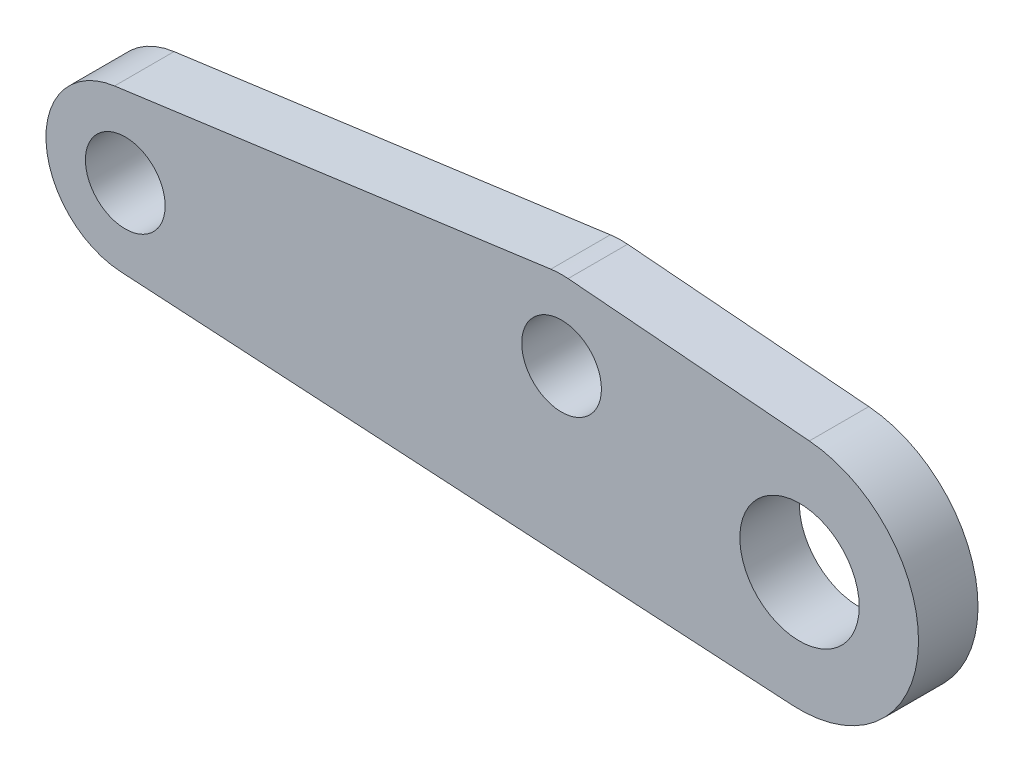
ISO-10303-21;
HEADER;
FILE_DESCRIPTION(('STEP AP214'),'2;1');
FILE_NAME('part.step','',(''),(''),'','','');
FILE_SCHEMA(('AUTOMOTIVE_DESIGN { 1 0 10303 214 1 1 1 1 }'));
ENDSEC;
DATA;
#1=APPLICATION_CONTEXT('core data for automotive mechanical design processes');
#2=APPLICATION_PROTOCOL_DEFINITION('international standard','automotive_design',2000,#1);
#3=PRODUCT_CONTEXT('',#1,'mechanical');
#4=PRODUCT('Part','Part','',(#3));
#5=PRODUCT_RELATED_PRODUCT_CATEGORY('part','',(#4));
#6=PRODUCT_DEFINITION_FORMATION('','',#4);
#7=PRODUCT_DEFINITION_CONTEXT('part definition',#1,'design');
#8=PRODUCT_DEFINITION('design','',#6,#7);
#9=PRODUCT_DEFINITION_SHAPE('','',#8);
#10=(LENGTH_UNIT() NAMED_UNIT(*) SI_UNIT(.MILLI.,.METRE.));
#11=(NAMED_UNIT(*) PLANE_ANGLE_UNIT() SI_UNIT($,.RADIAN.));
#12=(NAMED_UNIT(*) SI_UNIT($,.STERADIAN.) SOLID_ANGLE_UNIT());
#13=UNCERTAINTY_MEASURE_WITH_UNIT(LENGTH_MEASURE(1.E-05),#10,'distance_accuracy_value','');
#14=(GEOMETRIC_REPRESENTATION_CONTEXT(3) GLOBAL_UNCERTAINTY_ASSIGNED_CONTEXT((#13)) GLOBAL_UNIT_ASSIGNED_CONTEXT((#10,
#11,#12)) REPRESENTATION_CONTEXT('',''));
#15=CARTESIAN_POINT('',(0.,0.,0.));
#16=DIRECTION('',(0.,0.,1.));
#17=DIRECTION('',(1.,0.,0.));
#18=AXIS2_PLACEMENT_3D('',#15,#16,#17);
#19=CARTESIAN_POINT('',(0.,0.,15.));
#20=DIRECTION('',(0.,0.,1.));
#21=DIRECTION('',(1.,0.,0.));
#22=AXIS2_PLACEMENT_3D('',#19,#20,#21);
#23=PLANE('',#22);
#24=CARTESIAN_POINT('',(170.,0.,15.));
#25=DIRECTION('',(0.,0.,1.));
#26=DIRECTION('',(1.,0.,0.));
#27=AXIS2_PLACEMENT_3D('',#24,#25,#26);
#28=CIRCLE('',#27,15.05);
#29=CARTESIAN_POINT('',(185.05,0.,15.));
#30=VERTEX_POINT('',#29);
#31=EDGE_CURVE('E192',#30,#30,#28,.T.);
#32=ORIENTED_EDGE('',*,*,#31,.F.);
#33=EDGE_LOOP('',(#32));
#34=FACE_BOUND('',#33,.T.);
#35=CARTESIAN_POINT('',(0.,0.,15.));
#36=DIRECTION('',(0.,0.,1.));
#37=DIRECTION('',(1.,0.,0.));
#38=AXIS2_PLACEMENT_3D('',#35,#36,#37);
#39=CIRCLE('',#38,20.);
#40=CARTESIAN_POINT('',(-2.70226409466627,19.816603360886,15.));
#41=VERTEX_POINT('',#40);
#42=CARTESIAN_POINT('',(-1.17647058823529,-19.9653679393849,15.));
#43=VERTEX_POINT('',#42);
#44=EDGE_CURVE('E117',#41,#43,#39,.T.);
#45=ORIENTED_EDGE('',*,*,#44,.T.);
#46=DIRECTION('',(0.998268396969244,-0.0588235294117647,0.));
#47=VECTOR('',#46,1.);
#48=CARTESIAN_POINT('',(-1.17647058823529,-19.9653679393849,15.));
#49=LINE('',#48,#47);
#50=CARTESIAN_POINT('',(168.235294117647,-29.9480519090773,15.));
#51=VERTEX_POINT('',#50);
#52=EDGE_CURVE('E98',#43,#51,#49,.T.);
#53=ORIENTED_EDGE('',*,*,#52,.T.);
#54=CARTESIAN_POINT('',(170.,0.,15.));
#55=DIRECTION('',(0.,0.,1.));
#56=DIRECTION('',(1.,0.,0.));
#57=AXIS2_PLACEMENT_3D('',#54,#55,#56);
#58=CIRCLE('',#57,30.);
#59=CARTESIAN_POINT('',(172.474444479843,29.8977779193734,15.));
#60=VERTEX_POINT('',#59);
#61=EDGE_CURVE('E120',#51,#60,#58,.T.);
#62=ORIENTED_EDGE('',*,*,#61,.T.);
#63=DIRECTION('',(-0.996592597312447,0.0824814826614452,0.));
#64=VECTOR('',#63,1.);
#65=CARTESIAN_POINT('',(111.649629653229,34.9318519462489,15.));
#66=LINE('',#65,#64);
#67=CARTESIAN_POINT('',(111.649629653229,34.9318519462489,15.));
#68=VERTEX_POINT('',#67);
#69=EDGE_CURVE('E122',#60,#68,#66,.T.);
#70=ORIENTED_EDGE('',*,*,#69,.T.);
#71=CARTESIAN_POINT('',(110.,15.,15.));
#72=DIRECTION('',(0.,0.,1.));
#73=DIRECTION('',(1.,0.,0.));
#74=AXIS2_PLACEMENT_3D('',#71,#72,#73);
#75=CIRCLE('',#74,20.);
#76=CARTESIAN_POINT('',(107.297735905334,34.816603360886,15.));
#77=VERTEX_POINT('',#76);
#78=EDGE_CURVE('E51',#68,#77,#75,.T.);
#79=ORIENTED_EDGE('',*,*,#78,.T.);
#80=DIRECTION('',(-0.990830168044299,-0.135113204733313,0.));
#81=VECTOR('',#80,1.);
#82=CARTESIAN_POINT('',(-2.70226409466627,19.816603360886,15.));
#83=LINE('',#82,#81);
#84=EDGE_CURVE('E46',#77,#41,#83,.T.);
#85=ORIENTED_EDGE('',*,*,#84,.T.);
#86=EDGE_LOOP('',(#45,#53,#62,#70,#79,#85));
#87=FACE_BOUND('',#86,.T.);
#88=CARTESIAN_POINT('',(0.,0.,15.));
#89=DIRECTION('',(0.,0.,1.));
#90=DIRECTION('',(1.,0.,0.));
#91=AXIS2_PLACEMENT_3D('',#88,#89,#90);
#92=CIRCLE('',#91,10.05);
#93=CARTESIAN_POINT('',(10.05,0.,15.));
#94=VERTEX_POINT('',#93);
#95=EDGE_CURVE('E103',#94,#94,#92,.T.);
#96=ORIENTED_EDGE('',*,*,#95,.F.);
#97=EDGE_LOOP('',(#96));
#98=FACE_BOUND('',#97,.T.);
#99=CARTESIAN_POINT('',(110.,15.,15.));
#100=DIRECTION('',(0.,0.,1.));
#101=DIRECTION('',(1.,0.,0.));
#102=AXIS2_PLACEMENT_3D('',#99,#100,#101);
#103=CIRCLE('',#102,10.05);
#104=CARTESIAN_POINT('',(120.05,15.,15.));
#105=VERTEX_POINT('',#104);
#106=EDGE_CURVE('E181',#105,#105,#103,.T.);
#107=ORIENTED_EDGE('',*,*,#106,.F.);
#108=EDGE_LOOP('',(#107));
#109=FACE_BOUND('',#108,.T.);
#110=ADVANCED_FACE('F31',(#34,#87,#98,#109),#23,.T.);
#111=CARTESIAN_POINT('',(0.,0.,0.));
#112=DIRECTION('',(0.,0.,1.));
#113=DIRECTION('',(1.,0.,0.));
#114=AXIS2_PLACEMENT_3D('',#111,#112,#113);
#115=PLANE('',#114);
#116=CARTESIAN_POINT('',(170.,0.,0.));
#117=DIRECTION('',(0.,0.,1.));
#118=DIRECTION('',(1.,0.,0.));
#119=AXIS2_PLACEMENT_3D('',#116,#117,#118);
#120=CIRCLE('',#119,15.05);
#121=CARTESIAN_POINT('',(185.05,0.,0.));
#122=VERTEX_POINT('',#121);
#123=EDGE_CURVE('E187',#122,#122,#120,.T.);
#124=ORIENTED_EDGE('',*,*,#123,.T.);
#125=EDGE_LOOP('',(#124));
#126=FACE_BOUND('',#125,.T.);
#127=CARTESIAN_POINT('',(0.,0.,0.));
#128=DIRECTION('',(0.,0.,1.));
#129=DIRECTION('',(1.,0.,0.));
#130=AXIS2_PLACEMENT_3D('',#127,#128,#129);
#131=CIRCLE('',#130,20.);
#132=CARTESIAN_POINT('',(-2.70226409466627,19.816603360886,0.));
#133=VERTEX_POINT('',#132);
#134=CARTESIAN_POINT('',(-1.17647058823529,-19.9653679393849,0.));
#135=VERTEX_POINT('',#134);
#136=EDGE_CURVE('E89',#133,#135,#131,.T.);
#137=ORIENTED_EDGE('',*,*,#136,.F.);
#138=DIRECTION('',(-0.990830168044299,-0.135113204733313,0.));
#139=VECTOR('',#138,1.);
#140=CARTESIAN_POINT('',(-2.70226409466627,19.816603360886,0.));
#141=LINE('',#140,#139);
#142=CARTESIAN_POINT('',(107.297735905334,34.816603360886,0.));
#143=VERTEX_POINT('',#142);
#144=EDGE_CURVE('E115',#143,#133,#141,.T.);
#145=ORIENTED_EDGE('',*,*,#144,.F.);
#146=CARTESIAN_POINT('',(110.,15.,0.));
#147=DIRECTION('',(0.,0.,1.));
#148=DIRECTION('',(1.,0.,0.));
#149=AXIS2_PLACEMENT_3D('',#146,#147,#148);
#150=CIRCLE('',#149,20.);
#151=CARTESIAN_POINT('',(111.649629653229,34.9318519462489,0.));
#152=VERTEX_POINT('',#151);
#153=EDGE_CURVE('E113',#152,#143,#150,.T.);
#154=ORIENTED_EDGE('',*,*,#153,.F.);
#155=DIRECTION('',(-0.996592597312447,0.0824814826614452,0.));
#156=VECTOR('',#155,1.);
#157=CARTESIAN_POINT('',(111.649629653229,34.9318519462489,0.));
#158=LINE('',#157,#156);
#159=CARTESIAN_POINT('',(172.474444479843,29.8977779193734,0.));
#160=VERTEX_POINT('',#159);
#161=EDGE_CURVE('E111',#160,#152,#158,.T.);
#162=ORIENTED_EDGE('',*,*,#161,.F.);
#163=CARTESIAN_POINT('',(170.,0.,0.));
#164=DIRECTION('',(0.,0.,1.));
#165=DIRECTION('',(1.,0.,0.));
#166=AXIS2_PLACEMENT_3D('',#163,#164,#165);
#167=CIRCLE('',#166,30.);
#168=CARTESIAN_POINT('',(168.235294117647,-29.9480519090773,0.));
#169=VERTEX_POINT('',#168);
#170=EDGE_CURVE('E91',#169,#160,#167,.T.);
#171=ORIENTED_EDGE('',*,*,#170,.F.);
#172=DIRECTION('',(0.998268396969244,-0.0588235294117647,0.));
#173=VECTOR('',#172,1.);
#174=CARTESIAN_POINT('',(-1.17647058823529,-19.9653679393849,0.));
#175=LINE('',#174,#173);
#176=EDGE_CURVE('E84',#135,#169,#175,.T.);
#177=ORIENTED_EDGE('',*,*,#176,.F.);
#178=EDGE_LOOP('',(#137,#145,#154,#162,#171,#177));
#179=FACE_BOUND('',#178,.T.);
#180=CARTESIAN_POINT('',(0.,0.,0.));
#181=DIRECTION('',(0.,0.,1.));
#182=DIRECTION('',(1.,0.,0.));
#183=AXIS2_PLACEMENT_3D('',#180,#181,#182);
#184=CIRCLE('',#183,10.05);
#185=CARTESIAN_POINT('',(10.05,0.,0.));
#186=VERTEX_POINT('',#185);
#187=EDGE_CURVE('E106',#186,#186,#184,.T.);
#188=ORIENTED_EDGE('',*,*,#187,.T.);
#189=EDGE_LOOP('',(#188));
#190=FACE_BOUND('',#189,.T.);
#191=CARTESIAN_POINT('',(110.,15.,0.));
#192=DIRECTION('',(0.,0.,1.));
#193=DIRECTION('',(1.,0.,0.));
#194=AXIS2_PLACEMENT_3D('',#191,#192,#193);
#195=CIRCLE('',#194,10.05);
#196=CARTESIAN_POINT('',(120.05,15.,0.));
#197=VERTEX_POINT('',#196);
#198=EDGE_CURVE('E184',#197,#197,#195,.T.);
#199=ORIENTED_EDGE('',*,*,#198,.T.);
#200=EDGE_LOOP('',(#199));
#201=FACE_BOUND('',#200,.T.);
#202=ADVANCED_FACE('F85',(#126,#179,#190,#201),#115,.F.);
#203=CARTESIAN_POINT('',(0.,0.,15.));
#204=DIRECTION('',(0.,0.,-1.));
#205=DIRECTION('',(-1.,0.,0.));
#206=AXIS2_PLACEMENT_3D('',#203,#204,#205);
#207=CYLINDRICAL_SURFACE('',#206,20.);
#208=ORIENTED_EDGE('',*,*,#136,.T.);
#209=DIRECTION('',(0.,0.,-1.));
#210=VECTOR('',#209,1.);
#211=CARTESIAN_POINT('',(-1.17647058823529,-19.9653679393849,15.));
#212=LINE('',#211,#210);
#213=EDGE_CURVE('E11',#43,#135,#212,.T.);
#214=ORIENTED_EDGE('',*,*,#213,.F.);
#215=ORIENTED_EDGE('',*,*,#44,.F.);
#216=DIRECTION('',(0.,0.,-1.));
#217=VECTOR('',#216,1.);
#218=CARTESIAN_POINT('',(-2.70226409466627,19.816603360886,15.));
#219=LINE('',#218,#217);
#220=EDGE_CURVE('E102',#41,#133,#219,.T.);
#221=ORIENTED_EDGE('',*,*,#220,.T.);
#222=EDGE_LOOP('',(#208,#214,#215,#221));
#223=FACE_BOUND('',#222,.T.);
#224=ADVANCED_FACE('F33',(#223),#207,.T.);
#225=CARTESIAN_POINT('',(-1.17647058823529,-19.9653679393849,15.));
#226=DIRECTION('',(0.0588235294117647,0.998268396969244,0.));
#227=DIRECTION('',(-0.998268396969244,0.0588235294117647,0.));
#228=AXIS2_PLACEMENT_3D('',#225,#226,#227);
#229=PLANE('',#228);
#230=ORIENTED_EDGE('',*,*,#176,.T.);
#231=DIRECTION('',(0.,0.,-1.));
#232=VECTOR('',#231,1.);
#233=CARTESIAN_POINT('',(168.235294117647,-29.9480519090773,15.));
#234=LINE('',#233,#232);
#235=EDGE_CURVE('E39',#51,#169,#234,.T.);
#236=ORIENTED_EDGE('',*,*,#235,.F.);
#237=ORIENTED_EDGE('',*,*,#52,.F.);
#238=ORIENTED_EDGE('',*,*,#213,.T.);
#239=EDGE_LOOP('',(#230,#236,#237,#238));
#240=FACE_BOUND('',#239,.T.);
#241=ADVANCED_FACE('F97',(#240),#229,.F.);
#242=CARTESIAN_POINT('',(170.,0.,15.));
#243=DIRECTION('',(0.,0.,-1.));
#244=DIRECTION('',(-1.,0.,0.));
#245=AXIS2_PLACEMENT_3D('',#242,#243,#244);
#246=CYLINDRICAL_SURFACE('',#245,30.);
#247=ORIENTED_EDGE('',*,*,#170,.T.);
#248=DIRECTION('',(0.,0.,-1.));
#249=VECTOR('',#248,1.);
#250=CARTESIAN_POINT('',(172.474444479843,29.8977779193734,15.));
#251=LINE('',#250,#249);
#252=EDGE_CURVE('E133',#60,#160,#251,.T.);
#253=ORIENTED_EDGE('',*,*,#252,.F.);
#254=ORIENTED_EDGE('',*,*,#61,.F.);
#255=ORIENTED_EDGE('',*,*,#235,.T.);
#256=EDGE_LOOP('',(#247,#253,#254,#255));
#257=FACE_BOUND('',#256,.T.);
#258=ADVANCED_FACE('F137',(#257),#246,.T.);
#259=CARTESIAN_POINT('',(111.649629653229,34.9318519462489,15.));
#260=DIRECTION('',(-0.0824814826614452,-0.996592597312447,0.));
#261=DIRECTION('',(0.996592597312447,-0.0824814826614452,0.));
#262=AXIS2_PLACEMENT_3D('',#259,#260,#261);
#263=PLANE('',#262);
#264=ORIENTED_EDGE('',*,*,#161,.T.);
#265=DIRECTION('',(0.,0.,-1.));
#266=VECTOR('',#265,1.);
#267=CARTESIAN_POINT('',(111.649629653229,34.9318519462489,15.));
#268=LINE('',#267,#266);
#269=EDGE_CURVE('E130',#68,#152,#268,.T.);
#270=ORIENTED_EDGE('',*,*,#269,.F.);
#271=ORIENTED_EDGE('',*,*,#69,.F.);
#272=ORIENTED_EDGE('',*,*,#252,.T.);
#273=EDGE_LOOP('',(#264,#270,#271,#272));
#274=FACE_BOUND('',#273,.T.);
#275=ADVANCED_FACE('F143',(#274),#263,.F.);
#276=CARTESIAN_POINT('',(110.,15.,15.));
#277=DIRECTION('',(0.,0.,-1.));
#278=DIRECTION('',(-1.,0.,0.));
#279=AXIS2_PLACEMENT_3D('',#276,#277,#278);
#280=CYLINDRICAL_SURFACE('',#279,20.);
#281=ORIENTED_EDGE('',*,*,#153,.T.);
#282=DIRECTION('',(0.,0.,-1.));
#283=VECTOR('',#282,1.);
#284=CARTESIAN_POINT('',(107.297735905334,34.816603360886,15.));
#285=LINE('',#284,#283);
#286=EDGE_CURVE('E127',#77,#143,#285,.T.);
#287=ORIENTED_EDGE('',*,*,#286,.F.);
#288=ORIENTED_EDGE('',*,*,#78,.F.);
#289=ORIENTED_EDGE('',*,*,#269,.T.);
#290=EDGE_LOOP('',(#281,#287,#288,#289));
#291=FACE_BOUND('',#290,.T.);
#292=ADVANCED_FACE('F146',(#291),#280,.T.);
#293=CARTESIAN_POINT('',(-2.70226409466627,19.816603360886,15.));
#294=DIRECTION('',(0.135113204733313,-0.990830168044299,0.));
#295=DIRECTION('',(0.990830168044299,0.135113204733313,0.));
#296=AXIS2_PLACEMENT_3D('',#293,#294,#295);
#297=PLANE('',#296);
#298=ORIENTED_EDGE('',*,*,#144,.T.);
#299=ORIENTED_EDGE('',*,*,#220,.F.);
#300=ORIENTED_EDGE('',*,*,#84,.F.);
#301=ORIENTED_EDGE('',*,*,#286,.T.);
#302=EDGE_LOOP('',(#298,#299,#300,#301));
#303=FACE_BOUND('',#302,.T.);
#304=ADVANCED_FACE('F148',(#303),#297,.F.);
#305=CARTESIAN_POINT('',(0.,0.,15.));
#306=DIRECTION('',(0.,0.,-1.));
#307=DIRECTION('',(-1.,0.,0.));
#308=AXIS2_PLACEMENT_3D('',#305,#306,#307);
#309=CYLINDRICAL_SURFACE('',#308,10.05);
#310=ORIENTED_EDGE('',*,*,#95,.T.);
#311=EDGE_LOOP('',(#310));
#312=FACE_BOUND('',#311,.T.);
#313=ORIENTED_EDGE('',*,*,#187,.F.);
#314=EDGE_LOOP('',(#313));
#315=FACE_BOUND('',#314,.T.);
#316=ADVANCED_FACE('F150',(#312,#315),#309,.F.);
#317=CARTESIAN_POINT('',(170.,0.,15.));
#318=DIRECTION('',(0.,0.,-1.));
#319=DIRECTION('',(-1.,0.,0.));
#320=AXIS2_PLACEMENT_3D('',#317,#318,#319);
#321=CYLINDRICAL_SURFACE('',#320,15.05);
#322=ORIENTED_EDGE('',*,*,#31,.T.);
#323=EDGE_LOOP('',(#322));
#324=FACE_BOUND('',#323,.T.);
#325=ORIENTED_EDGE('',*,*,#123,.F.);
#326=EDGE_LOOP('',(#325));
#327=FACE_BOUND('',#326,.T.);
#328=ADVANCED_FACE('F156',(#324,#327),#321,.F.);
#329=CARTESIAN_POINT('',(110.,15.,15.));
#330=DIRECTION('',(0.,0.,-1.));
#331=DIRECTION('',(-1.,0.,0.));
#332=AXIS2_PLACEMENT_3D('',#329,#330,#331);
#333=CYLINDRICAL_SURFACE('',#332,10.05);
#334=ORIENTED_EDGE('',*,*,#106,.T.);
#335=EDGE_LOOP('',(#334));
#336=FACE_BOUND('',#335,.T.);
#337=ORIENTED_EDGE('',*,*,#198,.F.);
#338=EDGE_LOOP('',(#337));
#339=FACE_BOUND('',#338,.T.);
#340=ADVANCED_FACE('F172',(#336,#339),#333,.F.);
#341=CLOSED_SHELL('',(#110,#202,#224,#241,#258,#275,#292,#304,#316,#328,#340));
#342=MANIFOLD_SOLID_BREP('B2',#341);
#343=ADVANCED_BREP_SHAPE_REPRESENTATION('',(#18,#342),#14);
#344=SHAPE_DEFINITION_REPRESENTATION(#9,#343);
ENDSEC;
END-ISO-10303-21;
